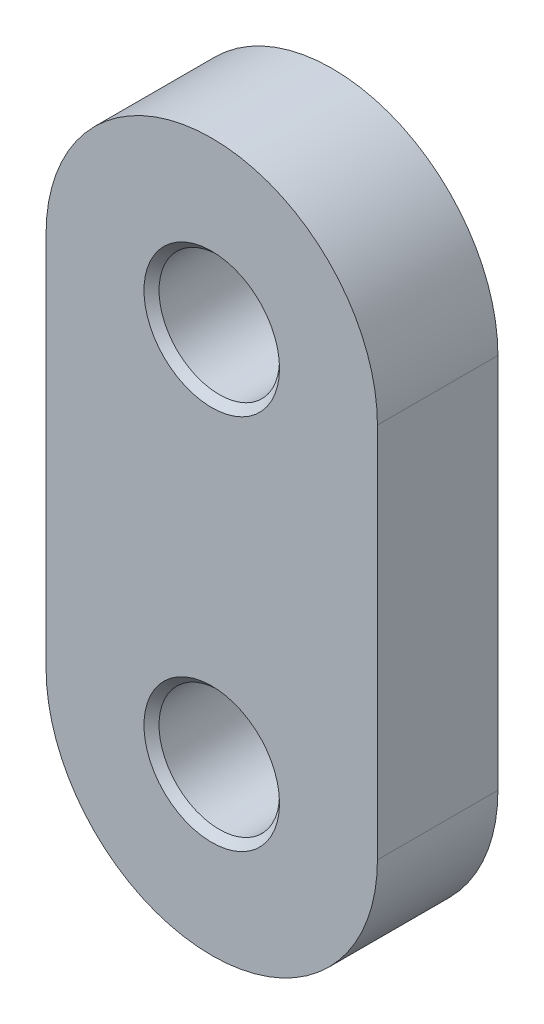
ISO-10303-21;
HEADER;
FILE_DESCRIPTION(('STEP AP214'),'2;1');
FILE_NAME('part.step','',(''),(''),'','','');
FILE_SCHEMA(('AUTOMOTIVE_DESIGN { 1 0 10303 214 1 1 1 1 }'));
ENDSEC;
DATA;
#1=APPLICATION_CONTEXT('core data for automotive mechanical design processes');
#2=APPLICATION_PROTOCOL_DEFINITION('international standard','automotive_design',2000,#1);
#3=PRODUCT_CONTEXT('',#1,'mechanical');
#4=PRODUCT('Part','Part','',(#3));
#5=PRODUCT_RELATED_PRODUCT_CATEGORY('part','',(#4));
#6=PRODUCT_DEFINITION_FORMATION('','',#4);
#7=PRODUCT_DEFINITION_CONTEXT('part definition',#1,'design');
#8=PRODUCT_DEFINITION('design','',#6,#7);
#9=PRODUCT_DEFINITION_SHAPE('','',#8);
#10=(LENGTH_UNIT() NAMED_UNIT(*) SI_UNIT(.MILLI.,.METRE.));
#11=(NAMED_UNIT(*) PLANE_ANGLE_UNIT() SI_UNIT($,.RADIAN.));
#12=(NAMED_UNIT(*) SI_UNIT($,.STERADIAN.) SOLID_ANGLE_UNIT());
#13=UNCERTAINTY_MEASURE_WITH_UNIT(LENGTH_MEASURE(1.E-05),#10,'distance_accuracy_value','');
#14=(GEOMETRIC_REPRESENTATION_CONTEXT(3) GLOBAL_UNCERTAINTY_ASSIGNED_CONTEXT((#13)) GLOBAL_UNIT_ASSIGNED_CONTEXT((#10,
#11,#12)) REPRESENTATION_CONTEXT('',''));
#15=CARTESIAN_POINT('',(0.,0.,0.));
#16=DIRECTION('',(0.,0.,1.));
#17=DIRECTION('',(1.,0.,0.));
#18=AXIS2_PLACEMENT_3D('',#15,#16,#17);
#19=CARTESIAN_POINT('',(0.,0.,8.));
#20=DIRECTION('',(0.,0.,-1.));
#21=DIRECTION('',(-1.,0.,0.));
#22=AXIS2_PLACEMENT_3D('',#19,#20,#21);
#23=CYLINDRICAL_SURFACE('',#22,11.);
#24=CARTESIAN_POINT('',(0.,0.,0.));
#25=DIRECTION('',(0.,0.,1.));
#26=DIRECTION('',(1.,0.,0.));
#27=AXIS2_PLACEMENT_3D('',#24,#25,#26);
#28=CIRCLE('',#27,11.);
#29=CARTESIAN_POINT('',(11.,0.,0.));
#30=VERTEX_POINT('',#29);
#31=CARTESIAN_POINT('',(-11.,0.,0.));
#32=VERTEX_POINT('',#31);
#33=EDGE_CURVE('E79',#30,#32,#28,.T.);
#34=ORIENTED_EDGE('',*,*,#33,.T.);
#35=DIRECTION('',(0.,0.,-1.));
#36=VECTOR('',#35,1.);
#37=CARTESIAN_POINT('',(-11.,0.,8.));
#38=LINE('',#37,#36);
#39=CARTESIAN_POINT('',(-11.,0.,8.));
#40=VERTEX_POINT('',#39);
#41=EDGE_CURVE('E86',#40,#32,#38,.T.);
#42=ORIENTED_EDGE('',*,*,#41,.F.);
#43=CARTESIAN_POINT('',(0.,0.,8.));
#44=DIRECTION('',(0.,0.,1.));
#45=DIRECTION('',(1.,0.,0.));
#46=AXIS2_PLACEMENT_3D('',#43,#44,#45);
#47=CIRCLE('',#46,11.);
#48=CARTESIAN_POINT('',(11.,0.,8.));
#49=VERTEX_POINT('',#48);
#50=EDGE_CURVE('E101',#49,#40,#47,.T.);
#51=ORIENTED_EDGE('',*,*,#50,.F.);
#52=DIRECTION('',(0.,0.,-1.));
#53=VECTOR('',#52,1.);
#54=CARTESIAN_POINT('',(11.,0.,8.));
#55=LINE('',#54,#53);
#56=EDGE_CURVE('E95',#49,#30,#55,.T.);
#57=ORIENTED_EDGE('',*,*,#56,.T.);
#58=EDGE_LOOP('',(#34,#42,#51,#57));
#59=FACE_BOUND('',#58,.T.);
#60=ADVANCED_FACE('F34',(#59),#23,.T.);
#61=CARTESIAN_POINT('',(-11.,0.,8.));
#62=DIRECTION('',(1.,0.,0.));
#63=DIRECTION('',(0.,1.,0.));
#64=AXIS2_PLACEMENT_3D('',#61,#62,#63);
#65=PLANE('',#64);
#66=DIRECTION('',(0.,-1.,0.));
#67=VECTOR('',#66,1.);
#68=CARTESIAN_POINT('',(-11.,0.,0.));
#69=LINE('',#68,#67);
#70=CARTESIAN_POINT('',(-11.,-25.,0.));
#71=VERTEX_POINT('',#70);
#72=EDGE_CURVE('E74',#32,#71,#69,.T.);
#73=ORIENTED_EDGE('',*,*,#72,.T.);
#74=DIRECTION('',(0.,0.,-1.));
#75=VECTOR('',#74,1.);
#76=CARTESIAN_POINT('',(-11.,-25.,8.));
#77=LINE('',#76,#75);
#78=CARTESIAN_POINT('',(-11.,-25.,8.));
#79=VERTEX_POINT('',#78);
#80=EDGE_CURVE('E92',#79,#71,#77,.T.);
#81=ORIENTED_EDGE('',*,*,#80,.F.);
#82=DIRECTION('',(0.,-1.,0.));
#83=VECTOR('',#82,1.);
#84=CARTESIAN_POINT('',(-11.,0.,8.));
#85=LINE('',#84,#83);
#86=EDGE_CURVE('E88',#40,#79,#85,.T.);
#87=ORIENTED_EDGE('',*,*,#86,.F.);
#88=ORIENTED_EDGE('',*,*,#41,.T.);
#89=EDGE_LOOP('',(#73,#81,#87,#88));
#90=FACE_BOUND('',#89,.T.);
#91=ADVANCED_FACE('F87',(#90),#65,.F.);
#92=CARTESIAN_POINT('',(0.,-25.,8.));
#93=DIRECTION('',(0.,0.,-1.));
#94=DIRECTION('',(-1.,0.,0.));
#95=AXIS2_PLACEMENT_3D('',#92,#93,#94);
#96=CYLINDRICAL_SURFACE('',#95,11.);
#97=CARTESIAN_POINT('',(0.,-25.,0.));
#98=DIRECTION('',(0.,0.,1.));
#99=DIRECTION('',(1.,0.,0.));
#100=AXIS2_PLACEMENT_3D('',#97,#98,#99);
#101=CIRCLE('',#100,11.);
#102=CARTESIAN_POINT('',(11.,-25.,0.));
#103=VERTEX_POINT('',#102);
#104=EDGE_CURVE('E80',#71,#103,#101,.T.);
#105=ORIENTED_EDGE('',*,*,#104,.T.);
#106=DIRECTION('',(0.,0.,-1.));
#107=VECTOR('',#106,1.);
#108=CARTESIAN_POINT('',(11.,-25.,8.));
#109=LINE('',#108,#107);
#110=CARTESIAN_POINT('',(11.,-25.,8.));
#111=VERTEX_POINT('',#110);
#112=EDGE_CURVE('E107',#111,#103,#109,.T.);
#113=ORIENTED_EDGE('',*,*,#112,.F.);
#114=CARTESIAN_POINT('',(0.,-25.,8.));
#115=DIRECTION('',(0.,0.,1.));
#116=DIRECTION('',(1.,0.,0.));
#117=AXIS2_PLACEMENT_3D('',#114,#115,#116);
#118=CIRCLE('',#117,11.);
#119=EDGE_CURVE('E53',#79,#111,#118,.T.);
#120=ORIENTED_EDGE('',*,*,#119,.F.);
#121=ORIENTED_EDGE('',*,*,#80,.T.);
#122=EDGE_LOOP('',(#105,#113,#120,#121));
#123=FACE_BOUND('',#122,.T.);
#124=ADVANCED_FACE('F148',(#123),#96,.T.);
#125=CARTESIAN_POINT('',(11.,-25.,8.));
#126=DIRECTION('',(-1.,0.,0.));
#127=DIRECTION('',(0.,-1.,0.));
#128=AXIS2_PLACEMENT_3D('',#125,#126,#127);
#129=PLANE('',#128);
#130=DIRECTION('',(0.,1.,0.));
#131=VECTOR('',#130,1.);
#132=CARTESIAN_POINT('',(11.,-25.,0.));
#133=LINE('',#132,#131);
#134=EDGE_CURVE('E99',#103,#30,#133,.T.);
#135=ORIENTED_EDGE('',*,*,#134,.T.);
#136=ORIENTED_EDGE('',*,*,#56,.F.);
#137=DIRECTION('',(0.,1.,0.));
#138=VECTOR('',#137,1.);
#139=CARTESIAN_POINT('',(11.,-25.,8.));
#140=LINE('',#139,#138);
#141=EDGE_CURVE('E48',#111,#49,#140,.T.);
#142=ORIENTED_EDGE('',*,*,#141,.F.);
#143=ORIENTED_EDGE('',*,*,#112,.T.);
#144=EDGE_LOOP('',(#135,#136,#142,#143));
#145=FACE_BOUND('',#144,.T.);
#146=ADVANCED_FACE('F152',(#145),#129,.F.);
#147=CARTESIAN_POINT('',(0.,0.,8.));
#148=DIRECTION('',(0.,0.,1.));
#149=DIRECTION('',(1.,0.,0.));
#150=AXIS2_PLACEMENT_3D('',#147,#148,#149);
#151=PLANE('',#150);
#152=CARTESIAN_POINT('',(0.,0.,8.));
#153=DIRECTION('',(0.,0.,1.));
#154=DIRECTION('',(1.,0.,0.));
#155=AXIS2_PLACEMENT_3D('',#152,#153,#154);
#156=CIRCLE('',#155,4.5);
#157=CARTESIAN_POINT('',(4.5,0.,8.));
#158=VERTEX_POINT('',#157);
#159=EDGE_CURVE('E119',#158,#158,#156,.F.);
#160=ORIENTED_EDGE('',*,*,#159,.T.);
#161=EDGE_LOOP('',(#160));
#162=FACE_BOUND('',#161,.T.);
#163=CARTESIAN_POINT('',(0.,-25.,8.));
#164=DIRECTION('',(0.,0.,1.));
#165=DIRECTION('',(1.,0.,0.));
#166=AXIS2_PLACEMENT_3D('',#163,#164,#165);
#167=CIRCLE('',#166,4.5);
#168=CARTESIAN_POINT('',(4.5,-25.,8.));
#169=VERTEX_POINT('',#168);
#170=EDGE_CURVE('E116',#169,#169,#167,.F.);
#171=ORIENTED_EDGE('',*,*,#170,.T.);
#172=EDGE_LOOP('',(#171));
#173=FACE_BOUND('',#172,.T.);
#174=ORIENTED_EDGE('',*,*,#50,.T.);
#175=ORIENTED_EDGE('',*,*,#86,.T.);
#176=ORIENTED_EDGE('',*,*,#119,.T.);
#177=ORIENTED_EDGE('',*,*,#141,.T.);
#178=EDGE_LOOP('',(#174,#175,#176,#177));
#179=FACE_BOUND('',#178,.T.);
#180=ADVANCED_FACE('F158',(#162,#173,#179),#151,.T.);
#181=CARTESIAN_POINT('',(0.,0.,0.));
#182=DIRECTION('',(0.,0.,1.));
#183=DIRECTION('',(1.,0.,0.));
#184=AXIS2_PLACEMENT_3D('',#181,#182,#183);
#185=PLANE('',#184);
#186=CARTESIAN_POINT('',(0.,0.,0.));
#187=DIRECTION('',(0.,0.,1.));
#188=DIRECTION('',(1.,0.,0.));
#189=AXIS2_PLACEMENT_3D('',#186,#187,#188);
#190=CIRCLE('',#189,4.50000000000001);
#191=CARTESIAN_POINT('',(4.50000000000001,0.,0.));
#192=VERTEX_POINT('',#191);
#193=EDGE_CURVE('E125',#192,#192,#190,.T.);
#194=ORIENTED_EDGE('',*,*,#193,.T.);
#195=EDGE_LOOP('',(#194));
#196=FACE_BOUND('',#195,.T.);
#197=CARTESIAN_POINT('',(0.,-25.,0.));
#198=DIRECTION('',(0.,0.,1.));
#199=DIRECTION('',(1.,0.,0.));
#200=AXIS2_PLACEMENT_3D('',#197,#198,#199);
#201=CIRCLE('',#200,4.5);
#202=CARTESIAN_POINT('',(4.5,-25.,0.));
#203=VERTEX_POINT('',#202);
#204=EDGE_CURVE('E122',#203,#203,#201,.T.);
#205=ORIENTED_EDGE('',*,*,#204,.T.);
#206=EDGE_LOOP('',(#205));
#207=FACE_BOUND('',#206,.T.);
#208=ORIENTED_EDGE('',*,*,#33,.F.);
#209=ORIENTED_EDGE('',*,*,#134,.F.);
#210=ORIENTED_EDGE('',*,*,#104,.F.);
#211=ORIENTED_EDGE('',*,*,#72,.F.);
#212=EDGE_LOOP('',(#208,#209,#210,#211));
#213=FACE_BOUND('',#212,.T.);
#214=ADVANCED_FACE('F76',(#196,#207,#213),#185,.F.);
#215=CARTESIAN_POINT('',(0.,0.,0.));
#216=DIRECTION('',(0.,0.,1.));
#217=DIRECTION('',(1.,0.,0.));
#218=AXIS2_PLACEMENT_3D('',#215,#216,#217);
#219=CYLINDRICAL_SURFACE('',#218,4.);
#220=CARTESIAN_POINT('',(0.,0.,7.49999999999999));
#221=DIRECTION('',(0.,0.,1.));
#222=DIRECTION('',(1.,0.,0.));
#223=AXIS2_PLACEMENT_3D('',#220,#221,#222);
#224=CIRCLE('',#223,4.);
#225=CARTESIAN_POINT('',(4.,0.,7.49999999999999));
#226=VERTEX_POINT('',#225);
#227=EDGE_CURVE('E113',#226,#226,#224,.T.);
#228=ORIENTED_EDGE('',*,*,#227,.T.);
#229=EDGE_LOOP('',(#228));
#230=FACE_BOUND('',#229,.T.);
#231=CARTESIAN_POINT('',(0.,0.,0.500000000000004));
#232=DIRECTION('',(0.,0.,1.));
#233=DIRECTION('',(1.,0.,0.));
#234=AXIS2_PLACEMENT_3D('',#231,#232,#233);
#235=CIRCLE('',#234,4.);
#236=CARTESIAN_POINT('',(4.,0.,0.500000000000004));
#237=VERTEX_POINT('',#236);
#238=EDGE_CURVE('E91',#237,#237,#235,.F.);
#239=ORIENTED_EDGE('',*,*,#238,.T.);
#240=EDGE_LOOP('',(#239));
#241=FACE_BOUND('',#240,.T.);
#242=ADVANCED_FACE('F165',(#230,#241),#219,.F.);
#243=CARTESIAN_POINT('',(0.,-25.,0.));
#244=DIRECTION('',(0.,0.,1.));
#245=DIRECTION('',(1.,0.,0.));
#246=AXIS2_PLACEMENT_3D('',#243,#244,#245);
#247=CYLINDRICAL_SURFACE('',#246,4.);
#248=CARTESIAN_POINT('',(0.,-25.,0.500000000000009));
#249=DIRECTION('',(0.,0.,1.));
#250=DIRECTION('',(1.,0.,0.));
#251=AXIS2_PLACEMENT_3D('',#248,#249,#250);
#252=CIRCLE('',#251,4.);
#253=CARTESIAN_POINT('',(4.,-25.,0.500000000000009));
#254=VERTEX_POINT('',#253);
#255=EDGE_CURVE('E11',#254,#254,#252,.F.);
#256=ORIENTED_EDGE('',*,*,#255,.T.);
#257=EDGE_LOOP('',(#256));
#258=FACE_BOUND('',#257,.T.);
#259=CARTESIAN_POINT('',(0.,-25.,7.49999999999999));
#260=DIRECTION('',(0.,0.,1.));
#261=DIRECTION('',(1.,0.,0.));
#262=AXIS2_PLACEMENT_3D('',#259,#260,#261);
#263=CIRCLE('',#262,4.);
#264=CARTESIAN_POINT('',(4.,-25.,7.49999999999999));
#265=VERTEX_POINT('',#264);
#266=EDGE_CURVE('E41',#265,#265,#263,.T.);
#267=ORIENTED_EDGE('',*,*,#266,.T.);
#268=EDGE_LOOP('',(#267));
#269=FACE_BOUND('',#268,.T.);
#270=ADVANCED_FACE('F130',(#258,#269),#247,.F.);
#271=CARTESIAN_POINT('',(0.,0.,7.49999999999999));
#272=DIRECTION('',(0.,0.,1.));
#273=DIRECTION('',(1.,0.,0.));
#274=AXIS2_PLACEMENT_3D('',#271,#272,#273);
#275=CONICAL_SURFACE('',#274,4.,0.785398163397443);
#276=ORIENTED_EDGE('',*,*,#159,.F.);
#277=EDGE_LOOP('',(#276));
#278=FACE_BOUND('',#277,.T.);
#279=ORIENTED_EDGE('',*,*,#227,.F.);
#280=EDGE_LOOP('',(#279));
#281=FACE_BOUND('',#280,.T.);
#282=ADVANCED_FACE('F172',(#278,#281),#275,.F.);
#283=CARTESIAN_POINT('',(0.,0.,0.));
#284=DIRECTION('',(0.,0.,-1.));
#285=DIRECTION('',(-1.,0.,0.));
#286=AXIS2_PLACEMENT_3D('',#283,#284,#285);
#287=CONICAL_SURFACE('',#286,4.50000000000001,0.785398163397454);
#288=ORIENTED_EDGE('',*,*,#238,.F.);
#289=EDGE_LOOP('',(#288));
#290=FACE_BOUND('',#289,.T.);
#291=ORIENTED_EDGE('',*,*,#193,.F.);
#292=EDGE_LOOP('',(#291));
#293=FACE_BOUND('',#292,.T.);
#294=ADVANCED_FACE('F140',(#290,#293),#287,.F.);
#295=CARTESIAN_POINT('',(0.,-25.,0.));
#296=DIRECTION('',(0.,0.,-1.));
#297=DIRECTION('',(-1.,0.,0.));
#298=AXIS2_PLACEMENT_3D('',#295,#296,#297);
#299=CONICAL_SURFACE('',#298,4.5,0.785398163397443);
#300=ORIENTED_EDGE('',*,*,#255,.F.);
#301=EDGE_LOOP('',(#300));
#302=FACE_BOUND('',#301,.T.);
#303=ORIENTED_EDGE('',*,*,#204,.F.);
#304=EDGE_LOOP('',(#303));
#305=FACE_BOUND('',#304,.T.);
#306=ADVANCED_FACE('F134',(#302,#305),#299,.F.);
#307=CARTESIAN_POINT('',(0.,-25.,7.49999999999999));
#308=DIRECTION('',(0.,0.,1.));
#309=DIRECTION('',(1.,0.,0.));
#310=AXIS2_PLACEMENT_3D('',#307,#308,#309);
#311=CONICAL_SURFACE('',#310,4.,0.785398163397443);
#312=ORIENTED_EDGE('',*,*,#170,.F.);
#313=EDGE_LOOP('',(#312));
#314=FACE_BOUND('',#313,.T.);
#315=ORIENTED_EDGE('',*,*,#266,.F.);
#316=EDGE_LOOP('',(#315));
#317=FACE_BOUND('',#316,.T.);
#318=ADVANCED_FACE('F132',(#314,#317),#311,.F.);
#319=CLOSED_SHELL('',(#60,#91,#124,#146,#180,#214,#242,#270,#282,#294,#306,#318));
#320=MANIFOLD_SOLID_BREP('B2',#319);
#321=ADVANCED_BREP_SHAPE_REPRESENTATION('',(#18,#320),#14);
#322=SHAPE_DEFINITION_REPRESENTATION(#9,#321);
ENDSEC;
END-ISO-10303-21;
